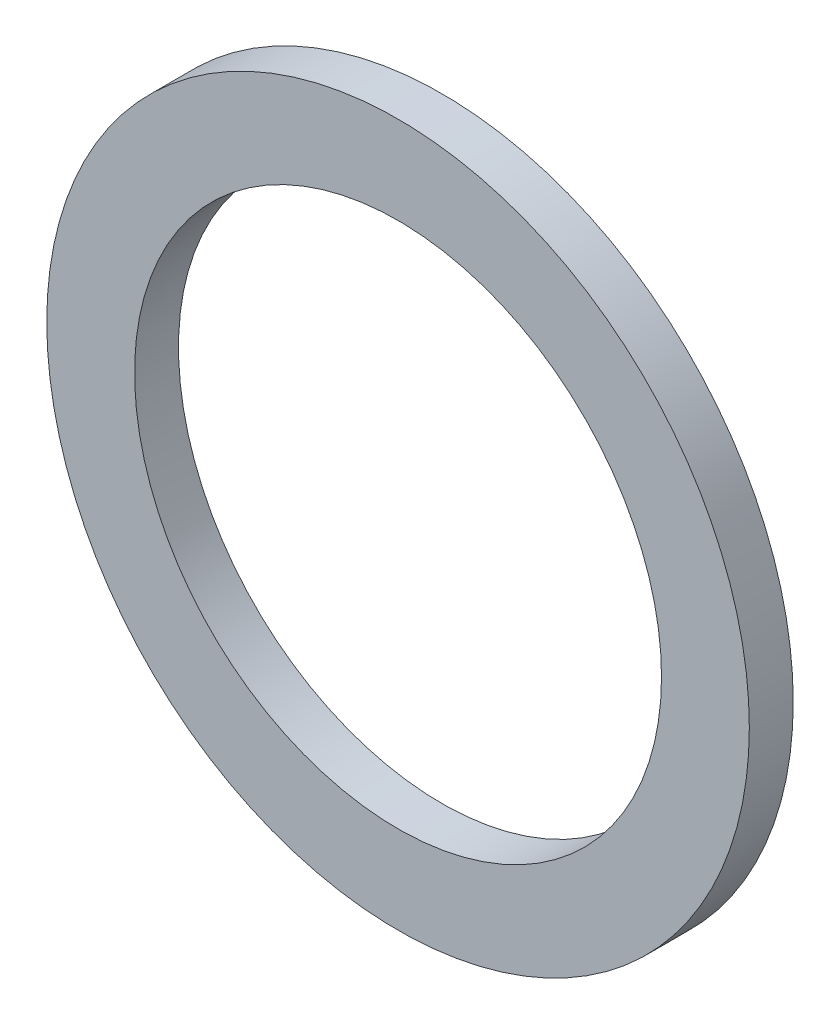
ISO-10303-21;
HEADER;
FILE_DESCRIPTION(('STEP AP214'),'2;1');
FILE_NAME('part.step','',(''),(''),'','','');
FILE_SCHEMA(('AUTOMOTIVE_DESIGN { 1 0 10303 214 1 1 1 1 }'));
ENDSEC;
DATA;
#1=APPLICATION_CONTEXT('core data for automotive mechanical design processes');
#2=APPLICATION_PROTOCOL_DEFINITION('international standard','automotive_design',2000,#1);
#3=PRODUCT_CONTEXT('',#1,'mechanical');
#4=PRODUCT('Part','Part','',(#3));
#5=PRODUCT_RELATED_PRODUCT_CATEGORY('part','',(#4));
#6=PRODUCT_DEFINITION_FORMATION('','',#4);
#7=PRODUCT_DEFINITION_CONTEXT('part definition',#1,'design');
#8=PRODUCT_DEFINITION('design','',#6,#7);
#9=PRODUCT_DEFINITION_SHAPE('','',#8);
#10=(LENGTH_UNIT() NAMED_UNIT(*) SI_UNIT(.MILLI.,.METRE.));
#11=(NAMED_UNIT(*) PLANE_ANGLE_UNIT() SI_UNIT($,.RADIAN.));
#12=(NAMED_UNIT(*) SI_UNIT($,.STERADIAN.) SOLID_ANGLE_UNIT());
#13=UNCERTAINTY_MEASURE_WITH_UNIT(LENGTH_MEASURE(1.E-05),#10,'distance_accuracy_value','');
#14=(GEOMETRIC_REPRESENTATION_CONTEXT(3) GLOBAL_UNCERTAINTY_ASSIGNED_CONTEXT((#13)) GLOBAL_UNIT_ASSIGNED_CONTEXT((#10,
#11,#12)) REPRESENTATION_CONTEXT('',''));
#15=CARTESIAN_POINT('',(0.,0.,0.));
#16=DIRECTION('',(0.,0.,1.));
#17=DIRECTION('',(1.,0.,0.));
#18=AXIS2_PLACEMENT_3D('',#15,#16,#17);
#19=CARTESIAN_POINT('',(0.,0.,-1.));
#20=DIRECTION('',(0.,0.,1.));
#21=DIRECTION('',(1.,0.,0.));
#22=AXIS2_PLACEMENT_3D('',#19,#20,#21);
#23=CYLINDRICAL_SURFACE('',#22,8.);
#24=CARTESIAN_POINT('',(0.,0.,-1.));
#25=DIRECTION('',(0.,0.,1.));
#26=DIRECTION('',(1.,0.,0.));
#27=AXIS2_PLACEMENT_3D('',#24,#25,#26);
#28=CIRCLE('',#27,8.);
#29=CARTESIAN_POINT('',(8.,0.,-1.));
#30=VERTEX_POINT('',#29);
#31=EDGE_CURVE('E10',#30,#30,#28,.T.);
#32=ORIENTED_EDGE('',*,*,#31,.T.);
#33=EDGE_LOOP('',(#32));
#34=FACE_BOUND('',#33,.T.);
#35=CARTESIAN_POINT('',(0.,0.,0.));
#36=DIRECTION('',(0.,0.,1.));
#37=DIRECTION('',(1.,0.,0.));
#38=AXIS2_PLACEMENT_3D('',#35,#36,#37);
#39=CIRCLE('',#38,8.);
#40=CARTESIAN_POINT('',(8.,0.,0.));
#41=VERTEX_POINT('',#40);
#42=EDGE_CURVE('E34',#41,#41,#39,.T.);
#43=ORIENTED_EDGE('',*,*,#42,.F.);
#44=EDGE_LOOP('',(#43));
#45=FACE_BOUND('',#44,.T.);
#46=ADVANCED_FACE('F31',(#34,#45),#23,.T.);
#47=CARTESIAN_POINT('',(0.,0.,-1.));
#48=DIRECTION('',(0.,0.,1.));
#49=DIRECTION('',(1.,0.,0.));
#50=AXIS2_PLACEMENT_3D('',#47,#48,#49);
#51=PLANE('',#50);
#52=CARTESIAN_POINT('',(0.,0.,-1.));
#53=DIRECTION('',(0.,0.,1.));
#54=DIRECTION('',(1.,0.,0.));
#55=AXIS2_PLACEMENT_3D('',#52,#53,#54);
#56=CIRCLE('',#55,6.);
#57=CARTESIAN_POINT('',(6.,0.,-1.));
#58=VERTEX_POINT('',#57);
#59=EDGE_CURVE('E41',#58,#58,#56,.T.);
#60=ORIENTED_EDGE('',*,*,#59,.T.);
#61=EDGE_LOOP('',(#60));
#62=FACE_BOUND('',#61,.T.);
#63=ORIENTED_EDGE('',*,*,#31,.F.);
#64=EDGE_LOOP('',(#63));
#65=FACE_BOUND('',#64,.T.);
#66=ADVANCED_FACE('F49',(#62,#65),#51,.F.);
#67=CARTESIAN_POINT('',(0.,0.,0.));
#68=DIRECTION('',(0.,0.,1.));
#69=DIRECTION('',(1.,0.,0.));
#70=AXIS2_PLACEMENT_3D('',#67,#68,#69);
#71=PLANE('',#70);
#72=CARTESIAN_POINT('',(0.,0.,0.));
#73=DIRECTION('',(0.,0.,1.));
#74=DIRECTION('',(1.,0.,0.));
#75=AXIS2_PLACEMENT_3D('',#72,#73,#74);
#76=CIRCLE('',#75,6.);
#77=CARTESIAN_POINT('',(6.,0.,0.));
#78=VERTEX_POINT('',#77);
#79=EDGE_CURVE('E43',#78,#78,#76,.T.);
#80=ORIENTED_EDGE('',*,*,#79,.F.);
#81=EDGE_LOOP('',(#80));
#82=FACE_BOUND('',#81,.T.);
#83=ORIENTED_EDGE('',*,*,#42,.T.);
#84=EDGE_LOOP('',(#83));
#85=FACE_BOUND('',#84,.T.);
#86=ADVANCED_FACE('F55',(#82,#85),#71,.T.);
#87=CARTESIAN_POINT('',(0.,0.,-1.));
#88=DIRECTION('',(0.,0.,1.));
#89=DIRECTION('',(1.,0.,0.));
#90=AXIS2_PLACEMENT_3D('',#87,#88,#89);
#91=CYLINDRICAL_SURFACE('',#90,6.);
#92=ORIENTED_EDGE('',*,*,#59,.F.);
#93=EDGE_LOOP('',(#92));
#94=FACE_BOUND('',#93,.T.);
#95=ORIENTED_EDGE('',*,*,#79,.T.);
#96=EDGE_LOOP('',(#95));
#97=FACE_BOUND('',#96,.T.);
#98=ADVANCED_FACE('F52',(#94,#97),#91,.F.);
#99=CLOSED_SHELL('',(#46,#66,#86,#98));
#100=MANIFOLD_SOLID_BREP('B2',#99);
#101=ADVANCED_BREP_SHAPE_REPRESENTATION('',(#18,#100),#14);
#102=SHAPE_DEFINITION_REPRESENTATION(#9,#101);
ENDSEC;
END-ISO-10303-21;
